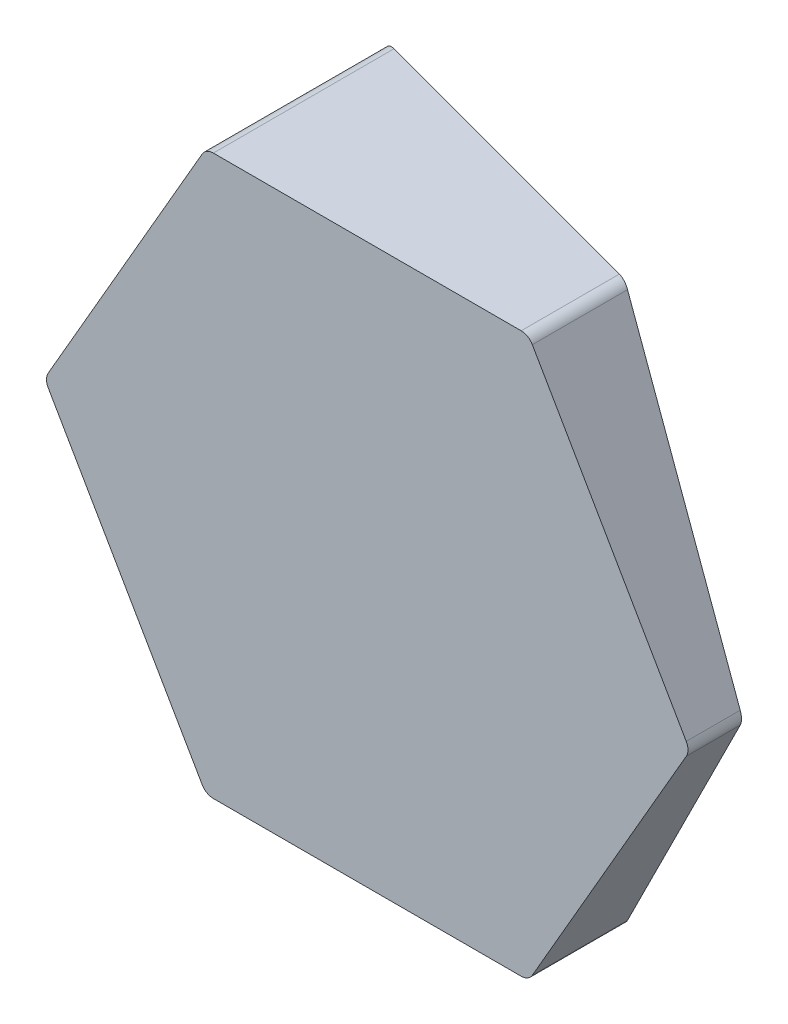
ISO-10303-21;
HEADER;
FILE_DESCRIPTION(('STEP AP214'),'2;1');
FILE_NAME('part.step','',(''),(''),'','','');
FILE_SCHEMA(('AUTOMOTIVE_DESIGN { 1 0 10303 214 1 1 1 1 }'));
ENDSEC;
DATA;
#1=APPLICATION_CONTEXT('core data for automotive mechanical design processes');
#2=APPLICATION_PROTOCOL_DEFINITION('international standard','automotive_design',2000,#1);
#3=PRODUCT_CONTEXT('',#1,'mechanical');
#4=PRODUCT('Part','Part','',(#3));
#5=PRODUCT_RELATED_PRODUCT_CATEGORY('part','',(#4));
#6=PRODUCT_DEFINITION_FORMATION('','',#4);
#7=PRODUCT_DEFINITION_CONTEXT('part definition',#1,'design');
#8=PRODUCT_DEFINITION('design','',#6,#7);
#9=PRODUCT_DEFINITION_SHAPE('','',#8);
#10=(LENGTH_UNIT() NAMED_UNIT(*) SI_UNIT(.MILLI.,.METRE.));
#11=(NAMED_UNIT(*) PLANE_ANGLE_UNIT() SI_UNIT($,.RADIAN.));
#12=(NAMED_UNIT(*) SI_UNIT($,.STERADIAN.) SOLID_ANGLE_UNIT());
#13=UNCERTAINTY_MEASURE_WITH_UNIT(LENGTH_MEASURE(1.E-05),#10,'distance_accuracy_value','');
#14=(GEOMETRIC_REPRESENTATION_CONTEXT(3) GLOBAL_UNCERTAINTY_ASSIGNED_CONTEXT((#13)) GLOBAL_UNIT_ASSIGNED_CONTEXT((#10,
#11,#12)) REPRESENTATION_CONTEXT('',''));
#15=CARTESIAN_POINT('',(0.,0.,0.));
#16=DIRECTION('',(0.,0.,1.));
#17=DIRECTION('',(1.,0.,0.));
#18=AXIS2_PLACEMENT_3D('',#15,#16,#17);
#19=CARTESIAN_POINT('',(25.0000000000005,-43.3012701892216,35.));
#20=DIRECTION('',(-0.866025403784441,0.499999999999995,0.));
#21=DIRECTION('',(-0.499999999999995,-0.866025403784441,0.));
#22=AXIS2_PLACEMENT_3D('',#19,#20,#21);
#23=PLANE('',#22);
#24=DIRECTION('',(0.499999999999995,0.866025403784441,0.));
#25=VECTOR('',#24,1.);
#26=CARTESIAN_POINT('',(25.0000000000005,-43.3012701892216,35.));
#27=LINE('',#26,#25);
#28=CARTESIAN_POINT('',(25.5773502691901,-42.3012701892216,35.));
#29=VERTEX_POINT('',#28);
#30=CARTESIAN_POINT('',(49.4226497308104,-1.,35.));
#31=VERTEX_POINT('',#30);
#32=EDGE_CURVE('E166',#29,#31,#27,.T.);
#33=ORIENTED_EDGE('',*,*,#32,.F.);
#34=DIRECTION('',(0.,0.,-1.));
#35=VECTOR('',#34,1.);
#36=CARTESIAN_POINT('',(25.5773502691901,-42.3012701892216,35.));
#37=LINE('',#36,#35);
#38=CARTESIAN_POINT('',(25.5773502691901,-42.3012701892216,20.250889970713));
#39=VERTEX_POINT('',#38);
#40=EDGE_CURVE('E11',#29,#39,#37,.T.);
#41=ORIENTED_EDGE('',*,*,#40,.T.);
#42=DIRECTION('',(0.495572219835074,0.858356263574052,0.132788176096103));
#43=VECTOR('',#42,1.);
#44=CARTESIAN_POINT('',(25.9807621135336,-41.6025403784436,20.358983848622));
#45=LINE('',#44,#43);
#46=CARTESIAN_POINT('',(49.4226497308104,-1.00000000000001,26.6402187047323));
#47=VERTEX_POINT('',#46);
#48=EDGE_CURVE('E157',#39,#47,#45,.T.);
#49=ORIENTED_EDGE('',*,*,#48,.T.);
#50=DIRECTION('',(0.,0.,-1.));
#51=VECTOR('',#50,1.);
#52=CARTESIAN_POINT('',(49.4226497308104,-1.,35.));
#53=LINE('',#52,#51);
#54=EDGE_CURVE('E43',#47,#31,#53,.F.);
#55=ORIENTED_EDGE('',*,*,#54,.T.);
#56=EDGE_LOOP('',(#33,#41,#49,#55));
#57=FACE_BOUND('',#56,.T.);
#58=ADVANCED_FACE('F35',(#57),#23,.F.);
#59=CARTESIAN_POINT('',(50.,0.,35.));
#60=DIRECTION('',(-0.866025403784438,-0.500000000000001,0.));
#61=DIRECTION('',(0.500000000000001,-0.866025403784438,0.));
#62=AXIS2_PLACEMENT_3D('',#59,#60,#61);
#63=PLANE('',#62);
#64=DIRECTION('',(-0.49557221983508,0.858356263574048,-0.132788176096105));
#65=VECTOR('',#64,1.);
#66=CARTESIAN_POINT('',(50.5399446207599,-0.935211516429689,26.9395969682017));
#67=LINE('',#66,#65);
#68=CARTESIAN_POINT('',(49.4226497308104,0.999999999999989,26.6402187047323));
#69=VERTEX_POINT('',#68);
#70=CARTESIAN_POINT('',(25.5773502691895,42.301270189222,20.2508899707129));
#71=VERTEX_POINT('',#70);
#72=EDGE_CURVE('E153',#69,#71,#67,.T.);
#73=ORIENTED_EDGE('',*,*,#72,.T.);
#74=DIRECTION('',(0.,0.,-1.));
#75=VECTOR('',#74,1.);
#76=CARTESIAN_POINT('',(25.5773502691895,42.301270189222,35.));
#77=LINE('',#76,#75);
#78=CARTESIAN_POINT('',(25.5773502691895,42.301270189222,35.));
#79=VERTEX_POINT('',#78);
#80=EDGE_CURVE('E205',#71,#79,#77,.F.);
#81=ORIENTED_EDGE('',*,*,#80,.T.);
#82=DIRECTION('',(-0.500000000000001,0.866025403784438,0.));
#83=VECTOR('',#82,1.);
#84=CARTESIAN_POINT('',(50.,0.,35.));
#85=LINE('',#84,#83);
#86=CARTESIAN_POINT('',(49.4226497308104,0.999999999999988,35.));
#87=VERTEX_POINT('',#86);
#88=EDGE_CURVE('E169',#87,#79,#85,.T.);
#89=ORIENTED_EDGE('',*,*,#88,.F.);
#90=DIRECTION('',(0.,0.,-1.));
#91=VECTOR('',#90,1.);
#92=CARTESIAN_POINT('',(49.4226497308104,0.999999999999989,35.));
#93=LINE('',#92,#91);
#94=EDGE_CURVE('E202',#87,#69,#93,.T.);
#95=ORIENTED_EDGE('',*,*,#94,.T.);
#96=EDGE_LOOP('',(#73,#81,#89,#95));
#97=FACE_BOUND('',#96,.T.);
#98=ADVANCED_FACE('F228',(#97),#63,.F.);
#99=CARTESIAN_POINT('',(24.9999999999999,43.301270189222,35.));
#100=DIRECTION('',(0.,-1.,0.));
#101=DIRECTION('',(1.,0.,0.));
#102=AXIS2_PLACEMENT_3D('',#99,#100,#101);
#103=PLANE('',#102);
#104=DIRECTION('',(0.96592582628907,0.,0.258819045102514));
#105=VECTOR('',#104,1.);
#106=CARTESIAN_POINT('',(-50.,43.301270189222,0.));
#107=LINE('',#106,#105);
#108=CARTESIAN_POINT('',(-23.8452994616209,43.301270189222,7.00813088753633));
#109=VERTEX_POINT('',#108);
#110=CARTESIAN_POINT('',(23.8452994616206,43.301270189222,19.7867883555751));
#111=VERTEX_POINT('',#110);
#112=EDGE_CURVE('E230',#109,#111,#107,.T.);
#113=ORIENTED_EDGE('',*,*,#112,.F.);
#114=DIRECTION('',(0.,0.,-1.));
#115=VECTOR('',#114,1.);
#116=CARTESIAN_POINT('',(-23.8452994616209,43.3012701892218,35.));
#117=LINE('',#116,#115);
#118=CARTESIAN_POINT('',(-23.8452994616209,43.3012701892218,35.));
#119=VERTEX_POINT('',#118);
#120=EDGE_CURVE('E131',#109,#119,#117,.F.);
#121=ORIENTED_EDGE('',*,*,#120,.T.);
#122=DIRECTION('',(-1.,0.,0.));
#123=VECTOR('',#122,1.);
#124=CARTESIAN_POINT('',(24.9999999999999,43.301270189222,35.));
#125=LINE('',#124,#123);
#126=CARTESIAN_POINT('',(23.8452994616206,43.301270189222,35.));
#127=VERTEX_POINT('',#126);
#128=EDGE_CURVE('E172',#127,#119,#125,.T.);
#129=ORIENTED_EDGE('',*,*,#128,.F.);
#130=DIRECTION('',(0.,0.,-1.));
#131=VECTOR('',#130,1.);
#132=CARTESIAN_POINT('',(23.8452994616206,43.301270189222,35.));
#133=LINE('',#132,#131);
#134=EDGE_CURVE('E136',#127,#111,#133,.T.);
#135=ORIENTED_EDGE('',*,*,#134,.T.);
#136=EDGE_LOOP('',(#113,#121,#129,#135));
#137=FACE_BOUND('',#136,.T.);
#138=ADVANCED_FACE('F237',(#137),#103,.F.);
#139=CARTESIAN_POINT('',(-25.0000000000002,43.3012701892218,35.));
#140=DIRECTION('',(0.866025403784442,-0.499999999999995,0.));
#141=DIRECTION('',(0.499999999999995,0.866025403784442,0.));
#142=AXIS2_PLACEMENT_3D('',#139,#140,#141);
#143=PLANE('',#142);
#144=DIRECTION('',(-0.499999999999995,-0.866025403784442,0.));
#145=VECTOR('',#144,1.);
#146=CARTESIAN_POINT('',(-25.0000000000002,43.3012701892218,35.));
#147=LINE('',#146,#145);
#148=CARTESIAN_POINT('',(-25.5773502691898,42.3012701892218,35.));
#149=VERTEX_POINT('',#148);
#150=CARTESIAN_POINT('',(-49.4226497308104,0.999999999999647,35.));
#151=VERTEX_POINT('',#150);
#152=EDGE_CURVE('E146',#149,#151,#147,.T.);
#153=ORIENTED_EDGE('',*,*,#152,.F.);
#154=DIRECTION('',(0.,0.,-1.));
#155=VECTOR('',#154,1.);
#156=CARTESIAN_POINT('',(-25.5773502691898,42.3012701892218,35.));
#157=LINE('',#156,#155);
#158=CARTESIAN_POINT('',(-25.5773502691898,42.3012701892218,6.54402927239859));
#159=VERTEX_POINT('',#158);
#160=EDGE_CURVE('E130',#149,#159,#157,.T.);
#161=ORIENTED_EDGE('',*,*,#160,.T.);
#162=DIRECTION('',(-0.495572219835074,-0.858356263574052,-0.132788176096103));
#163=VECTOR('',#162,1.);
#164=CARTESIAN_POINT('',(-23.1376029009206,46.5270365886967,7.19775760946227));
#165=LINE('',#164,#163);
#166=CARTESIAN_POINT('',(-49.4226497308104,0.99999999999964,0.154700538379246));
#167=VERTEX_POINT('',#166);
#168=EDGE_CURVE('E143',#159,#167,#165,.T.);
#169=ORIENTED_EDGE('',*,*,#168,.T.);
#170=DIRECTION('',(0.,0.,-1.));
#171=VECTOR('',#170,1.);
#172=CARTESIAN_POINT('',(-49.4226497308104,0.999999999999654,35.));
#173=LINE('',#172,#171);
#174=EDGE_CURVE('E148',#167,#151,#173,.F.);
#175=ORIENTED_EDGE('',*,*,#174,.T.);
#176=EDGE_LOOP('',(#153,#161,#169,#175));
#177=FACE_BOUND('',#176,.T.);
#178=ADVANCED_FACE('F142',(#177),#143,.F.);
#179=CARTESIAN_POINT('',(-50.,-3.49148133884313E-13,35.));
#180=DIRECTION('',(0.866025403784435,0.500000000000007,0.));
#181=DIRECTION('',(-0.500000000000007,0.866025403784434,0.));
#182=AXIS2_PLACEMENT_3D('',#179,#180,#181);
#183=PLANE('',#182);
#184=DIRECTION('',(0.500000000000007,-0.866025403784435,0.));
#185=VECTOR('',#184,1.);
#186=CARTESIAN_POINT('',(-50.,-3.49148133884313E-13,35.));
#187=LINE('',#186,#185);
#188=CARTESIAN_POINT('',(-49.4226497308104,-1.00000000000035,35.));
#189=VERTEX_POINT('',#188);
#190=CARTESIAN_POINT('',(-25.5773502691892,-42.3012701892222,35.));
#191=VERTEX_POINT('',#190);
#192=EDGE_CURVE('E176',#189,#191,#187,.T.);
#193=ORIENTED_EDGE('',*,*,#192,.F.);
#194=DIRECTION('',(0.,0.,-1.));
#195=VECTOR('',#194,1.);
#196=CARTESIAN_POINT('',(-49.4226497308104,-1.00000000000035,35.));
#197=LINE('',#196,#195);
#198=CARTESIAN_POINT('',(-49.4226497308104,-1.00000000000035,0.154700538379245));
#199=VERTEX_POINT('',#198);
#200=EDGE_CURVE('E209',#189,#199,#197,.T.);
#201=ORIENTED_EDGE('',*,*,#200,.T.);
#202=DIRECTION('',(0.495572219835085,-0.858356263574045,0.132788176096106));
#203=VECTOR('',#202,1.);
#204=CARTESIAN_POINT('',(-47.696785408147,-3.98928469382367,0.617144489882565));
#205=LINE('',#204,#203);
#206=CARTESIAN_POINT('',(-25.5773502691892,-42.3012701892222,6.54402927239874));
#207=VERTEX_POINT('',#206);
#208=EDGE_CURVE('E154',#199,#207,#205,.T.);
#209=ORIENTED_EDGE('',*,*,#208,.T.);
#210=DIRECTION('',(0.,0.,-1.));
#211=VECTOR('',#210,1.);
#212=CARTESIAN_POINT('',(-25.5773502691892,-42.3012701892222,35.));
#213=LINE('',#212,#211);
#214=EDGE_CURVE('E207',#207,#191,#213,.F.);
#215=ORIENTED_EDGE('',*,*,#214,.T.);
#216=EDGE_LOOP('',(#193,#201,#209,#215));
#217=FACE_BOUND('',#216,.T.);
#218=ADVANCED_FACE('F244',(#217),#183,.F.);
#219=CARTESIAN_POINT('',(-24.9999999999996,-43.3012701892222,35.));
#220=DIRECTION('',(0.,1.,0.));
#221=DIRECTION('',(-1.,0.,0.));
#222=AXIS2_PLACEMENT_3D('',#219,#220,#221);
#223=PLANE('',#222);
#224=DIRECTION('',(1.,0.,0.));
#225=VECTOR('',#224,1.);
#226=CARTESIAN_POINT('',(-24.9999999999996,-43.3012701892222,35.));
#227=LINE('',#226,#225);
#228=CARTESIAN_POINT('',(-23.8452994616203,-43.3012701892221,35.));
#229=VERTEX_POINT('',#228);
#230=CARTESIAN_POINT('',(23.8452994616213,-43.3012701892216,35.));
#231=VERTEX_POINT('',#230);
#232=EDGE_CURVE('E178',#229,#231,#227,.T.);
#233=ORIENTED_EDGE('',*,*,#232,.F.);
#234=DIRECTION('',(0.,0.,-1.));
#235=VECTOR('',#234,1.);
#236=CARTESIAN_POINT('',(-23.8452994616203,-43.3012701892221,35.));
#237=LINE('',#236,#235);
#238=CARTESIAN_POINT('',(-23.8452994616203,-43.3012701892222,7.00813088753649));
#239=VERTEX_POINT('',#238);
#240=EDGE_CURVE('E213',#229,#239,#237,.T.);
#241=ORIENTED_EDGE('',*,*,#240,.T.);
#242=DIRECTION('',(0.96592582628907,0.,0.258819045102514));
#243=VECTOR('',#242,1.);
#244=CARTESIAN_POINT('',(-50.,-43.3012701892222,0.));
#245=LINE('',#244,#243);
#246=CARTESIAN_POINT('',(23.8452994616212,-43.3012701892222,19.7867883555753));
#247=VERTEX_POINT('',#246);
#248=EDGE_CURVE('E160',#239,#247,#245,.T.);
#249=ORIENTED_EDGE('',*,*,#248,.T.);
#250=DIRECTION('',(0.,0.,-1.));
#251=VECTOR('',#250,1.);
#252=CARTESIAN_POINT('',(23.8452994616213,-43.3012701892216,35.));
#253=LINE('',#252,#251);
#254=EDGE_CURVE('E50',#247,#231,#253,.F.);
#255=ORIENTED_EDGE('',*,*,#254,.T.);
#256=EDGE_LOOP('',(#233,#241,#249,#255));
#257=FACE_BOUND('',#256,.T.);
#258=ADVANCED_FACE('F250',(#257),#223,.F.);
#259=CARTESIAN_POINT('',(0.,0.,35.));
#260=DIRECTION('',(0.,0.,1.));
#261=DIRECTION('',(1.,0.,0.));
#262=AXIS2_PLACEMENT_3D('',#259,#260,#261);
#263=PLANE('',#262);
#264=ORIENTED_EDGE('',*,*,#128,.T.);
#265=CARTESIAN_POINT('',(-23.8452994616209,41.3012701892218,35.));
#266=DIRECTION('',(0.,0.,1.));
#267=DIRECTION('',(1.,0.,0.));
#268=AXIS2_PLACEMENT_3D('',#265,#266,#267);
#269=CIRCLE('',#268,2.);
#270=EDGE_CURVE('E200',#119,#149,#269,.T.);
#271=ORIENTED_EDGE('',*,*,#270,.T.);
#272=ORIENTED_EDGE('',*,*,#152,.T.);
#273=CARTESIAN_POINT('',(-47.6905989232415,-3.33066907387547E-13,35.));
#274=DIRECTION('',(0.,0.,1.));
#275=DIRECTION('',(1.,0.,0.));
#276=AXIS2_PLACEMENT_3D('',#273,#274,#275);
#277=CIRCLE('',#276,2.);
#278=EDGE_CURVE('E196',#151,#189,#277,.T.);
#279=ORIENTED_EDGE('',*,*,#278,.T.);
#280=ORIENTED_EDGE('',*,*,#192,.T.);
#281=CARTESIAN_POINT('',(-23.8452994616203,-41.3012701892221,35.));
#282=DIRECTION('',(0.,0.,1.));
#283=DIRECTION('',(1.,0.,0.));
#284=AXIS2_PLACEMENT_3D('',#281,#282,#283);
#285=CIRCLE('',#284,2.);
#286=EDGE_CURVE('E57',#191,#229,#285,.T.);
#287=ORIENTED_EDGE('',*,*,#286,.T.);
#288=ORIENTED_EDGE('',*,*,#232,.T.);
#289=CARTESIAN_POINT('',(23.8452994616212,-41.3012701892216,35.));
#290=DIRECTION('',(0.,0.,1.));
#291=DIRECTION('',(1.,0.,0.));
#292=AXIS2_PLACEMENT_3D('',#289,#290,#291);
#293=CIRCLE('',#292,2.);
#294=EDGE_CURVE('E193',#231,#29,#293,.T.);
#295=ORIENTED_EDGE('',*,*,#294,.T.);
#296=ORIENTED_EDGE('',*,*,#32,.T.);
#297=CARTESIAN_POINT('',(47.6905989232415,0.,35.));
#298=DIRECTION('',(0.,0.,1.));
#299=DIRECTION('',(1.,0.,0.));
#300=AXIS2_PLACEMENT_3D('',#297,#298,#299);
#301=CIRCLE('',#300,2.);
#302=EDGE_CURVE('E191',#31,#87,#301,.T.);
#303=ORIENTED_EDGE('',*,*,#302,.T.);
#304=ORIENTED_EDGE('',*,*,#88,.T.);
#305=CARTESIAN_POINT('',(23.8452994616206,41.301270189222,35.));
#306=DIRECTION('',(0.,0.,1.));
#307=DIRECTION('',(1.,0.,0.));
#308=AXIS2_PLACEMENT_3D('',#305,#306,#307);
#309=CIRCLE('',#308,2.);
#310=EDGE_CURVE('E198',#79,#127,#309,.T.);
#311=ORIENTED_EDGE('',*,*,#310,.T.);
#312=EDGE_LOOP('',(#264,#271,#272,#279,#280,#287,#288,#295,#296,#303,#304,#311));
#313=FACE_BOUND('',#312,.T.);
#314=ADVANCED_FACE('F222',(#313),#263,.T.);
#315=CARTESIAN_POINT('',(-50.,-43.3012701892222,0.));
#316=DIRECTION('',(-0.258819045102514,0.,0.96592582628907));
#317=DIRECTION('',(0.96592582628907,0.,0.258819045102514));
#318=AXIS2_PLACEMENT_3D('',#315,#316,#317);
#319=PLANE('',#318);
#320=ORIENTED_EDGE('',*,*,#168,.F.);
#321=CARTESIAN_POINT('',(-23.8452994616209,41.3012701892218,7.00813088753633));
#322=DIRECTION('',(-0.258819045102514,0.,0.96592582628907));
#323=DIRECTION('',(-0.96592582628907,0.,-0.258819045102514));
#324=AXIS2_PLACEMENT_3D('',#321,#322,#323);
#325=ELLIPSE('',#324,2.07055236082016,2.);
#326=EDGE_CURVE('E126',#159,#109,#325,.F.);
#327=ORIENTED_EDGE('',*,*,#326,.T.);
#328=ORIENTED_EDGE('',*,*,#112,.T.);
#329=CARTESIAN_POINT('',(23.8452994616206,41.301270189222,19.7867883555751));
#330=DIRECTION('',(-0.258819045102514,0.,0.96592582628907));
#331=DIRECTION('',(-0.96592582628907,0.,-0.258819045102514));
#332=AXIS2_PLACEMENT_3D('',#329,#330,#331);
#333=ELLIPSE('',#332,2.07055236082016,2.);
#334=EDGE_CURVE('E137',#111,#71,#333,.F.);
#335=ORIENTED_EDGE('',*,*,#334,.T.);
#336=ORIENTED_EDGE('',*,*,#72,.F.);
#337=CARTESIAN_POINT('',(47.6905989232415,0.,26.1761170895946));
#338=DIRECTION('',(-0.258819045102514,0.,0.96592582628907));
#339=DIRECTION('',(-0.96592582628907,0.,-0.258819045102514));
#340=AXIS2_PLACEMENT_3D('',#337,#338,#339);
#341=ELLIPSE('',#340,2.07055236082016,2.);
#342=EDGE_CURVE('E147',#69,#47,#341,.F.);
#343=ORIENTED_EDGE('',*,*,#342,.T.);
#344=ORIENTED_EDGE('',*,*,#48,.F.);
#345=CARTESIAN_POINT('',(23.8452994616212,-41.3012701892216,19.7867883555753));
#346=DIRECTION('',(-0.258819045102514,0.,0.96592582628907));
#347=DIRECTION('',(-0.96592582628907,0.,-0.258819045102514));
#348=AXIS2_PLACEMENT_3D('',#345,#346,#347);
#349=ELLIPSE('',#348,2.07055236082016,2.);
#350=EDGE_CURVE('E182',#39,#247,#349,.F.);
#351=ORIENTED_EDGE('',*,*,#350,.T.);
#352=ORIENTED_EDGE('',*,*,#248,.F.);
#353=CARTESIAN_POINT('',(-23.8452994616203,-41.3012701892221,7.00813088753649));
#354=DIRECTION('',(-0.258819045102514,0.,0.96592582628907));
#355=DIRECTION('',(-0.96592582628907,0.,-0.258819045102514));
#356=AXIS2_PLACEMENT_3D('',#353,#354,#355);
#357=ELLIPSE('',#356,2.07055236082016,2.);
#358=EDGE_CURVE('E184',#239,#207,#357,.F.);
#359=ORIENTED_EDGE('',*,*,#358,.T.);
#360=ORIENTED_EDGE('',*,*,#208,.F.);
#361=CARTESIAN_POINT('',(-47.6905989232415,-3.33066907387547E-13,0.618802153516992));
#362=DIRECTION('',(-0.258819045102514,0.,0.96592582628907));
#363=DIRECTION('',(-0.96592582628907,0.,-0.258819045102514));
#364=AXIS2_PLACEMENT_3D('',#361,#362,#363);
#365=ELLIPSE('',#364,2.07055236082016,2.);
#366=EDGE_CURVE('E152',#199,#167,#365,.F.);
#367=ORIENTED_EDGE('',*,*,#366,.T.);
#368=EDGE_LOOP('',(#320,#327,#328,#335,#336,#343,#344,#351,#352,#359,#360,#367));
#369=FACE_BOUND('',#368,.T.);
#370=ADVANCED_FACE('F150',(#369),#319,.F.);
#371=CARTESIAN_POINT('',(-23.8452994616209,41.3012701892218,35.));
#372=DIRECTION('',(0.,0.,-1.));
#373=DIRECTION('',(-1.,0.,0.));
#374=AXIS2_PLACEMENT_3D('',#371,#372,#373);
#375=CYLINDRICAL_SURFACE('',#374,2.);
#376=ORIENTED_EDGE('',*,*,#270,.F.);
#377=ORIENTED_EDGE('',*,*,#120,.F.);
#378=ORIENTED_EDGE('',*,*,#326,.F.);
#379=ORIENTED_EDGE('',*,*,#160,.F.);
#380=EDGE_LOOP('',(#376,#377,#378,#379));
#381=FACE_BOUND('',#380,.T.);
#382=ADVANCED_FACE('F129',(#381),#375,.T.);
#383=CARTESIAN_POINT('',(23.8452994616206,41.301270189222,35.));
#384=DIRECTION('',(0.,0.,-1.));
#385=DIRECTION('',(-1.,0.,0.));
#386=AXIS2_PLACEMENT_3D('',#383,#384,#385);
#387=CYLINDRICAL_SURFACE('',#386,2.);
#388=ORIENTED_EDGE('',*,*,#310,.F.);
#389=ORIENTED_EDGE('',*,*,#80,.F.);
#390=ORIENTED_EDGE('',*,*,#334,.F.);
#391=ORIENTED_EDGE('',*,*,#134,.F.);
#392=EDGE_LOOP('',(#388,#389,#390,#391));
#393=FACE_BOUND('',#392,.T.);
#394=ADVANCED_FACE('F234',(#393),#387,.T.);
#395=CARTESIAN_POINT('',(-47.6905989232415,-3.33066907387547E-13,35.));
#396=DIRECTION('',(0.,0.,-1.));
#397=DIRECTION('',(-1.,0.,0.));
#398=AXIS2_PLACEMENT_3D('',#395,#396,#397);
#399=CYLINDRICAL_SURFACE('',#398,2.);
#400=ORIENTED_EDGE('',*,*,#278,.F.);
#401=ORIENTED_EDGE('',*,*,#174,.F.);
#402=ORIENTED_EDGE('',*,*,#366,.F.);
#403=ORIENTED_EDGE('',*,*,#200,.F.);
#404=EDGE_LOOP('',(#400,#401,#402,#403));
#405=FACE_BOUND('',#404,.T.);
#406=ADVANCED_FACE('F242',(#405),#399,.T.);
#407=CARTESIAN_POINT('',(-23.8452994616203,-41.3012701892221,35.));
#408=DIRECTION('',(0.,0.,-1.));
#409=DIRECTION('',(-1.,0.,0.));
#410=AXIS2_PLACEMENT_3D('',#407,#408,#409);
#411=CYLINDRICAL_SURFACE('',#410,2.);
#412=ORIENTED_EDGE('',*,*,#286,.F.);
#413=ORIENTED_EDGE('',*,*,#214,.F.);
#414=ORIENTED_EDGE('',*,*,#358,.F.);
#415=ORIENTED_EDGE('',*,*,#240,.F.);
#416=EDGE_LOOP('',(#412,#413,#414,#415));
#417=FACE_BOUND('',#416,.T.);
#418=ADVANCED_FACE('F249',(#417),#411,.T.);
#419=CARTESIAN_POINT('',(23.8452994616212,-41.3012701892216,35.));
#420=DIRECTION('',(0.,0.,-1.));
#421=DIRECTION('',(-1.,0.,0.));
#422=AXIS2_PLACEMENT_3D('',#419,#420,#421);
#423=CYLINDRICAL_SURFACE('',#422,2.);
#424=ORIENTED_EDGE('',*,*,#294,.F.);
#425=ORIENTED_EDGE('',*,*,#254,.F.);
#426=ORIENTED_EDGE('',*,*,#350,.F.);
#427=ORIENTED_EDGE('',*,*,#40,.F.);
#428=EDGE_LOOP('',(#424,#425,#426,#427));
#429=FACE_BOUND('',#428,.T.);
#430=ADVANCED_FACE('F252',(#429),#423,.T.);
#431=CARTESIAN_POINT('',(47.6905989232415,0.,35.));
#432=DIRECTION('',(0.,0.,-1.));
#433=DIRECTION('',(-1.,0.,0.));
#434=AXIS2_PLACEMENT_3D('',#431,#432,#433);
#435=CYLINDRICAL_SURFACE('',#434,2.);
#436=ORIENTED_EDGE('',*,*,#302,.F.);
#437=ORIENTED_EDGE('',*,*,#54,.F.);
#438=ORIENTED_EDGE('',*,*,#342,.F.);
#439=ORIENTED_EDGE('',*,*,#94,.F.);
#440=EDGE_LOOP('',(#436,#437,#438,#439));
#441=FACE_BOUND('',#440,.T.);
#442=ADVANCED_FACE('F37',(#441),#435,.T.);
#443=CLOSED_SHELL('',(#58,#98,#138,#178,#218,#258,#314,#370,#382,#394,#406,#418,#430,#442));
#444=MANIFOLD_SOLID_BREP('B2',#443);
#445=ADVANCED_BREP_SHAPE_REPRESENTATION('',(#18,#444),#14);
#446=SHAPE_DEFINITION_REPRESENTATION(#9,#445);
ENDSEC;
END-ISO-10303-21;
